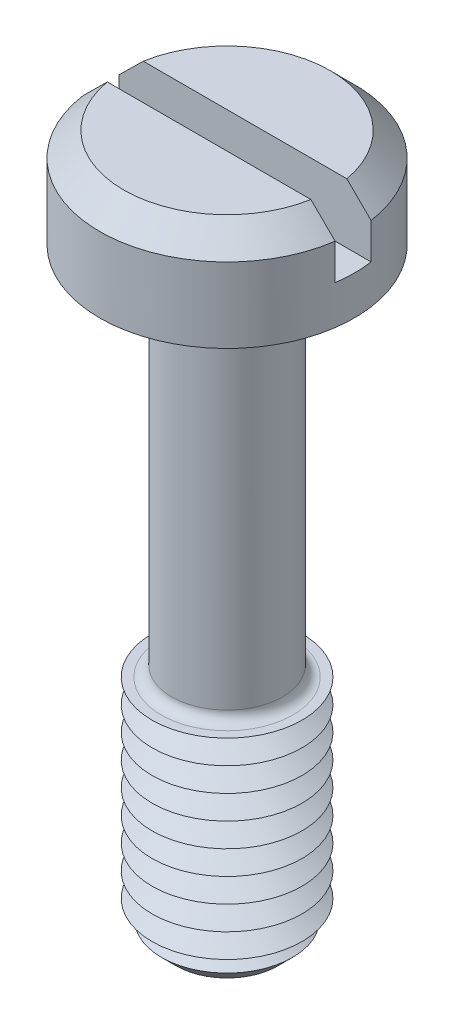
ISO-10303-21;
HEADER;
FILE_DESCRIPTION(('STEP AP214'),'2;1');
FILE_NAME('part.step','',(''),(''),'','','');
FILE_SCHEMA(('AUTOMOTIVE_DESIGN { 1 0 10303 214 1 1 1 1 }'));
ENDSEC;
DATA;
#1=APPLICATION_CONTEXT('core data for automotive mechanical design processes');
#2=APPLICATION_PROTOCOL_DEFINITION('international standard','automotive_design',2000,#1);
#3=PRODUCT_CONTEXT('',#1,'mechanical');
#4=PRODUCT('Part','Part','',(#3));
#5=PRODUCT_RELATED_PRODUCT_CATEGORY('part','',(#4));
#6=PRODUCT_DEFINITION_FORMATION('','',#4);
#7=PRODUCT_DEFINITION_CONTEXT('part definition',#1,'design');
#8=PRODUCT_DEFINITION('design','',#6,#7);
#9=PRODUCT_DEFINITION_SHAPE('','',#8);
#10=(LENGTH_UNIT() NAMED_UNIT(*) SI_UNIT(.MILLI.,.METRE.));
#11=(NAMED_UNIT(*) PLANE_ANGLE_UNIT() SI_UNIT($,.RADIAN.));
#12=(NAMED_UNIT(*) SI_UNIT($,.STERADIAN.) SOLID_ANGLE_UNIT());
#13=UNCERTAINTY_MEASURE_WITH_UNIT(LENGTH_MEASURE(1.E-05),#10,'distance_accuracy_value','');
#14=(GEOMETRIC_REPRESENTATION_CONTEXT(3) GLOBAL_UNCERTAINTY_ASSIGNED_CONTEXT((#13)) GLOBAL_UNIT_ASSIGNED_CONTEXT((#10,
#11,#12)) REPRESENTATION_CONTEXT('',''));
#15=CARTESIAN_POINT('',(0.,0.,0.));
#16=DIRECTION('',(0.,0.,1.));
#17=DIRECTION('',(1.,0.,0.));
#18=AXIS2_PLACEMENT_3D('',#15,#16,#17);
#19=CARTESIAN_POINT('',(0.,3.3,0.));
#20=DIRECTION('',(0.,1.,0.));
#21=DIRECTION('',(0.,0.,1.));
#22=AXIS2_PLACEMENT_3D('',#19,#20,#21);
#23=PLANE('',#22);
#24=DIRECTION('',(-1.,0.,0.));
#25=VECTOR('',#24,1.);
#26=CARTESIAN_POINT('',(4.25,3.3,-0.6));
#27=LINE('',#26,#25);
#28=CARTESIAN_POINT('',(3.39742549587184,3.3,-0.6));
#29=VERTEX_POINT('',#28);
#30=CARTESIAN_POINT('',(-3.39742549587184,3.3,-0.6));
#31=VERTEX_POINT('',#30);
#32=EDGE_CURVE('E110',#29,#31,#27,.T.);
#33=ORIENTED_EDGE('',*,*,#32,.F.);
#34=CARTESIAN_POINT('',(0.,3.3,0.));
#35=DIRECTION('',(0.,1.,0.));
#36=DIRECTION('',(0.,0.,1.));
#37=AXIS2_PLACEMENT_3D('',#34,#35,#36);
#38=CIRCLE('',#37,3.45);
#39=EDGE_CURVE('E113',#29,#31,#38,.T.);
#40=ORIENTED_EDGE('',*,*,#39,.T.);
#41=EDGE_LOOP('',(#33,#40));
#42=FACE_BOUND('',#41,.T.);
#43=ADVANCED_FACE('F39',(#42),#23,.T.);
#44=CARTESIAN_POINT('',(0.,3.3,0.));
#45=DIRECTION('',(0.,-1.,0.));
#46=DIRECTION('',(0.,0.,-1.));
#47=AXIS2_PLACEMENT_3D('',#44,#45,#46);
#48=CONICAL_SURFACE('',#47,3.45,0.785398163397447);
#49=CARTESIAN_POINT('',(9.35351408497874,-2.62273843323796,-0.6));
#50=CARTESIAN_POINT('',(9.03263557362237,-2.30252317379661,-0.6));
#51=CARTESIAN_POINT('',(8.71172811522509,-1.98233690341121,-0.6));
#52=CARTESIAN_POINT('',(8.06981262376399,-1.34205341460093,-0.6));
#53=CARTESIAN_POINT('',(7.74880458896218,-1.02195619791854,-0.6));
#54=CARTESIAN_POINT('',(7.10652460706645,-0.381761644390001,-0.6));
#55=CARTESIAN_POINT('',(6.78525260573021,-0.0616643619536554,-0.6));
#56=CARTESIAN_POINT('',(6.14251393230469,0.57832320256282,-0.6));
#57=CARTESIAN_POINT('',(5.82104726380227,0.898213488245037,-0.6));
#58=CARTESIAN_POINT('',(5.1719620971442,1.54347500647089,-0.6));
#59=CARTESIAN_POINT('',(4.84433778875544,1.86884039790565,-0.6));
#60=CARTESIAN_POINT('',(4.35244442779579,2.35644593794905,-0.6));
#61=CARTESIAN_POINT('',(4.18839924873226,2.51891187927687,-0.6));
#62=CARTESIAN_POINT('',(3.86009606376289,2.84362679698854,-0.6));
#63=CARTESIAN_POINT('',(3.69583805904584,3.00587577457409,-0.6));
#64=CARTESIAN_POINT('',(3.36705354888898,3.33001661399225,-0.6));
#65=CARTESIAN_POINT('',(3.20252712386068,3.49190855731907,-0.6));
#66=CARTESIAN_POINT('',(2.87298689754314,3.81520272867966,-0.6));
#67=CARTESIAN_POINT('',(2.70797308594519,3.97660494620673,-0.6));
#68=CARTESIAN_POINT('',(2.37716903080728,4.29858210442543,-0.6));
#69=CARTESIAN_POINT('',(2.21137886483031,4.45915712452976,-0.6));
#70=CARTESIAN_POINT('',(1.96157219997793,4.69884609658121,-0.6));
#71=CARTESIAN_POINT('',(1.87811785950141,4.77854546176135,-0.6));
#72=CARTESIAN_POINT('',(1.71066064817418,4.93736532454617,-0.6));
#73=CARTESIAN_POINT('',(1.62665778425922,5.01648582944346,-0.6));
#74=CARTESIAN_POINT('',(1.49655488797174,5.13773269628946,-0.6));
#75=CARTESIAN_POINT('',(1.45074972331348,5.18017521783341,-0.6));
#76=CARTESIAN_POINT('',(1.35882119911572,5.26471614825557,-0.6));
#77=CARTESIAN_POINT('',(1.31269783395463,5.30681455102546,-0.6));
#78=CARTESIAN_POINT('',(1.22008852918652,5.39050695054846,-0.6));
#79=CARTESIAN_POINT('',(1.17360305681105,5.43210146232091,-0.6));
#80=CARTESIAN_POINT('',(1.08007401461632,5.51465347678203,-0.6));
#81=CARTESIAN_POINT('',(1.03303046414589,5.55561100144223,-0.6));
#82=CARTESIAN_POINT('',(0.919047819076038,5.65299331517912,-0.6));
#83=CARTESIAN_POINT('',(0.851738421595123,5.7089924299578,-0.6));
#84=CARTESIAN_POINT('',(0.748806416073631,5.79068526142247,-0.6));
#85=CARTESIAN_POINT('',(0.714125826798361,5.8175621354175,-0.6));
#86=CARTESIAN_POINT('',(0.643915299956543,5.8701807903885,-0.6));
#87=CARTESIAN_POINT('',(0.608385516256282,5.89592277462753,-0.6));
#88=CARTESIAN_POINT('',(0.545162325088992,5.93955652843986,-0.6));
#89=CARTESIAN_POINT('',(0.517718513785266,5.95780799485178,-0.6));
#90=CARTESIAN_POINT('',(0.462025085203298,5.99303174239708,-0.6));
#91=CARTESIAN_POINT('',(0.433775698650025,6.01000438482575,-0.6));
#92=CARTESIAN_POINT('',(0.376341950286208,6.04213837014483,-0.6));
#93=CARTESIAN_POINT('',(0.347160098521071,6.05730412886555,-0.6));
#94=CARTESIAN_POINT('',(0.2876425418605,6.08513394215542,-0.6));
#95=CARTESIAN_POINT('',(0.25730803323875,6.0978005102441,-0.6));
#96=CARTESIAN_POINT('',(0.190863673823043,6.12124627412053,-0.6));
#97=CARTESIAN_POINT('',(0.154554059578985,6.13148571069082,-0.6));
#98=CARTESIAN_POINT('',(0.0807909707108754,6.14565404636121,-0.6));
#99=CARTESIAN_POINT('',(0.0433423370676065,6.14960664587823,-0.6));
#100=CARTESIAN_POINT('',(-0.0317987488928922,6.15033783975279,-0.6));
#101=CARTESIAN_POINT('',(-0.069491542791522,6.14708428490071,-0.6));
#102=CARTESIAN_POINT('',(-0.143790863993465,6.13410921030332,-0.6));
#103=CARTESIAN_POINT('',(-0.18039362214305,6.12436747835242,-0.6));
#104=CARTESIAN_POINT('',(-0.254098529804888,6.09939647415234,-0.6));
#105=CARTESIAN_POINT('',(-0.291094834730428,6.08386859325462,-0.6));
#106=CARTESIAN_POINT('',(-0.363408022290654,6.04924663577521,-0.6));
#107=CARTESIAN_POINT('',(-0.398721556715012,6.03014579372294,-0.6));
#108=CARTESIAN_POINT('',(-0.468234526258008,5.98944452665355,-0.6));
#109=CARTESIAN_POINT('',(-0.502422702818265,5.96782521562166,-0.6));
#110=CARTESIAN_POINT('',(-0.569689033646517,5.92300618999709,-0.6));
#111=CARTESIAN_POINT('',(-0.602768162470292,5.89980792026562,-0.6));
#112=CARTESIAN_POINT('',(-0.671148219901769,5.85008963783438,-0.6));
#113=CARTESIAN_POINT('',(-0.706369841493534,5.82346130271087,-0.6));
#114=CARTESIAN_POINT('',(-0.776087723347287,5.76926828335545,-0.6));
#115=CARTESIAN_POINT('',(-0.810583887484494,5.74170347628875,-0.6));
#116=CARTESIAN_POINT('',(-0.913286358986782,5.65798278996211,-0.6));
#117=CARTESIAN_POINT('',(-0.980673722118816,5.60082541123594,-0.6));
#118=CARTESIAN_POINT('',(-1.11424616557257,5.48490670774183,-0.6));
#119=CARTESIAN_POINT('',(-1.18042891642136,5.42614273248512,-0.6));
#120=CARTESIAN_POINT('',(-1.31191262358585,5.30767463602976,-0.6));
#121=CARTESIAN_POINT('',(-1.37721382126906,5.24797078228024,-0.6));
#122=CARTESIAN_POINT('',(-1.5070108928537,5.12812906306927,-0.6));
#123=CARTESIAN_POINT('',(-1.57150872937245,5.06799331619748,-0.6));
#124=CARTESIAN_POINT('',(-1.70009132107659,4.94727328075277,-0.6));
#125=CARTESIAN_POINT('',(-1.76417604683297,4.88668896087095,-0.6));
#126=CARTESIAN_POINT('',(-1.95584105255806,4.70458824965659,-0.6));
#127=CARTESIAN_POINT('',(-2.08296922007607,4.58259645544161,-0.6));
#128=CARTESIAN_POINT('',(-2.33599178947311,4.33840625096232,-0.6));
#129=CARTESIAN_POINT('',(-2.46188913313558,4.21621087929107,-0.6));
#130=CARTESIAN_POINT('',(-2.71323511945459,3.97135925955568,-0.6));
#131=CARTESIAN_POINT('',(-2.83868376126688,3.84870301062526,-0.6));
#132=CARTESIAN_POINT('',(-3.21459106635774,3.48027743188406,-0.6));
#133=CARTESIAN_POINT('',(-3.46460626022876,3.2340559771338,-0.6));
#134=CARTESIAN_POINT('',(-3.96413793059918,2.74090313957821,-0.6));
#135=CARTESIAN_POINT('',(-4.21365415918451,2.4939715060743,-0.6));
#136=CARTESIAN_POINT('',(-4.71232475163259,1.99974737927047,-0.6));
#137=CARTESIAN_POINT('',(-4.96147911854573,1.7524548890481,-0.6));
#138=CARTESIAN_POINT('',(-5.45958725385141,1.25761544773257,-0.6));
#139=CARTESIAN_POINT('',(-5.70854099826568,1.01006847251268,-0.6));
#140=CARTESIAN_POINT('',(-6.20629498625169,0.514819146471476,-0.6));
#141=CARTESIAN_POINT('',(-6.45509522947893,0.267116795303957,-0.6));
#142=CARTESIAN_POINT('',(-7.20128563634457,-0.476100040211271,-0.6));
#143=CARTESIAN_POINT('',(-7.69851620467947,-0.971774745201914,-0.6));
#144=CARTESIAN_POINT('',(-8.38865115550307,-1.66007026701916,-0.6));
#145=CARTESIAN_POINT('',(-8.58165346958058,-1.85259293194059,-0.6));
#146=CARTESIAN_POINT('',(-8.87112736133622,-2.14139225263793,-0.6));
#147=CARTESIAN_POINT('',(-8.96761014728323,-2.23765767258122,-0.6));
#148=CARTESIAN_POINT('',(-9.16056764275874,-2.43019387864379,-0.6));
#149=CARTESIAN_POINT('',(-9.25704235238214,-2.52646466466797,-0.6));
#150=CARTESIAN_POINT('',(-9.35351408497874,-2.62273843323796,-0.6));
#151=B_SPLINE_CURVE_WITH_KNOTS('',3,(#49,#50,#51,#52,#53,#54,#55,#56,#57,#58,#59,#60,#61,#62,
#63,#64,#65,#66,#67,#68,#69,#70,#71,#72,#73,#74,#75,#76,#77,#78,#79,#80,#81,#82,#83,#84,#85,#86,
#87,#88,#89,#90,#91,#92,#93,#94,#95,#96,#97,#98,#99,#100,#101,#102,#103,#104,#105,#106,#107,
#108,#109,#110,#111,#112,#113,#114,#115,#116,#117,#118,#119,#120,#121,#122,#123,#124,#125,#126,
#127,#128,#129,#130,#131,#132,#133,#134,#135,#136,#137,#138,#139,#140,#141,#142,#143,#144,#145,
#146,#147,#148,#149,#150),.UNSPECIFIED.,.F.,.F.,(4,2,2,2,2,2,2,2,2,2,2,2,2,2,2,2,2,2,2,2,2,2,2,
2,2,2,2,2,2,2,2,2,2,2,2,2,2,2,2,2,2,2,2,2,2,2,2,2,2,2,4),(0.,1.35996600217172,2.71995696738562,
4.08050889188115,5.44103646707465,6.82624457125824,7.51888721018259,8.21152599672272,
8.9039856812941,9.59646011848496,10.288866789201,10.635058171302,10.9812451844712,
11.1685812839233,11.3559207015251,11.5430489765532,11.7301707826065,11.9927784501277,
12.1243921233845,12.2559821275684,12.3548333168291,12.4536564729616,12.5522329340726,
12.6507097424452,12.763461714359,12.8757876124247,12.9886156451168,13.101796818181,
13.2218851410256,13.3422031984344,13.4634899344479,13.584667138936,13.7171086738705,
13.8495676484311,14.1146090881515,14.3801178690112,14.6455524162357,14.910099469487,
15.17466516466,15.7032346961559,16.2295761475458,16.7559185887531,17.8086237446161,
18.8617626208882,19.9148925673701,20.9681337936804,22.0213773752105,24.1276499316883,
24.9454725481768,25.3543534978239,25.7632286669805),.UNSPECIFIED.);
#152=CARTESIAN_POINT('',(4.20743389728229,2.49999999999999,-0.6));
#153=VERTEX_POINT('',#152);
#154=EDGE_CURVE('E268',#153,#29,#151,.T.);
#155=ORIENTED_EDGE('',*,*,#154,.F.);
#156=CARTESIAN_POINT('',(0.,2.5,0.));
#157=DIRECTION('',(0.,1.,0.));
#158=DIRECTION('',(0.,0.,1.));
#159=AXIS2_PLACEMENT_3D('',#156,#157,#158);
#160=CIRCLE('',#159,4.25);
#161=CARTESIAN_POINT('',(-4.20743389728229,2.49999999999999,-0.6));
#162=VERTEX_POINT('',#161);
#163=EDGE_CURVE('E128',#162,#153,#160,.F.);
#164=ORIENTED_EDGE('',*,*,#163,.F.);
#165=EDGE_CURVE('E102',#31,#162,#151,.T.);
#166=ORIENTED_EDGE('',*,*,#165,.F.);
#167=ORIENTED_EDGE('',*,*,#39,.F.);
#168=EDGE_LOOP('',(#155,#164,#166,#167));
#169=FACE_BOUND('',#168,.T.);
#170=ADVANCED_FACE('F230',(#169),#48,.T.);
#171=CARTESIAN_POINT('',(0.,-20.,0.));
#172=DIRECTION('',(0.,1.,0.));
#173=DIRECTION('',(0.,0.,1.));
#174=AXIS2_PLACEMENT_3D('',#171,#172,#173);
#175=CYLINDRICAL_SURFACE('',#174,1.85);
#176=CARTESIAN_POINT('',(0.,-12.15,0.));
#177=DIRECTION('',(0.,-1.,0.));
#178=DIRECTION('',(0.,0.,-1.));
#179=AXIS2_PLACEMENT_3D('',#176,#177,#178);
#180=CIRCLE('',#179,1.85);
#181=CARTESIAN_POINT('',(0.,-12.15,-1.85));
#182=VERTEX_POINT('',#181);
#183=EDGE_CURVE('E123',#182,#182,#180,.F.);
#184=ORIENTED_EDGE('',*,*,#183,.T.);
#185=EDGE_LOOP('',(#184));
#186=FACE_BOUND('',#185,.T.);
#187=CARTESIAN_POINT('',(0.,-0.35,0.));
#188=DIRECTION('',(0.,1.,0.));
#189=DIRECTION('',(0.,0.,1.));
#190=AXIS2_PLACEMENT_3D('',#187,#188,#189);
#191=CIRCLE('',#190,1.85);
#192=CARTESIAN_POINT('',(0.,-0.35,1.85));
#193=VERTEX_POINT('',#192);
#194=EDGE_CURVE('E382',#193,#193,#191,.F.);
#195=ORIENTED_EDGE('',*,*,#194,.T.);
#196=EDGE_LOOP('',(#195));
#197=FACE_BOUND('',#196,.T.);
#198=ADVANCED_FACE('F226',(#186,#197),#175,.T.);
#199=CARTESIAN_POINT('',(0.,3.3,0.));
#200=DIRECTION('',(0.,-1.,0.));
#201=DIRECTION('',(0.,0.,-1.));
#202=AXIS2_PLACEMENT_3D('',#199,#200,#201);
#203=CYLINDRICAL_SURFACE('',#202,4.25);
#204=ORIENTED_EDGE('',*,*,#163,.T.);
#205=DIRECTION('',(0.,-1.,0.));
#206=VECTOR('',#205,1.);
#207=CARTESIAN_POINT('',(4.20743389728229,3.3,-0.6));
#208=LINE('',#207,#206);
#209=CARTESIAN_POINT('',(4.20743389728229,1.3,-0.6));
#210=VERTEX_POINT('',#209);
#211=EDGE_CURVE('E64',#153,#210,#208,.T.);
#212=ORIENTED_EDGE('',*,*,#211,.T.);
#213=CARTESIAN_POINT('',(0.,1.3,0.));
#214=DIRECTION('',(0.,1.,0.));
#215=DIRECTION('',(0.,0.,1.));
#216=AXIS2_PLACEMENT_3D('',#213,#214,#215);
#217=CIRCLE('',#216,4.25);
#218=CARTESIAN_POINT('',(4.20743389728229,1.3,0.6));
#219=VERTEX_POINT('',#218);
#220=EDGE_CURVE('E11',#219,#210,#217,.T.);
#221=ORIENTED_EDGE('',*,*,#220,.F.);
#222=DIRECTION('',(0.,-1.,0.));
#223=VECTOR('',#222,1.);
#224=CARTESIAN_POINT('',(4.20743389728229,3.3,0.6));
#225=LINE('',#224,#223);
#226=CARTESIAN_POINT('',(4.20743389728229,2.49999999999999,0.6));
#227=VERTEX_POINT('',#226);
#228=EDGE_CURVE('E284',#219,#227,#225,.F.);
#229=ORIENTED_EDGE('',*,*,#228,.T.);
#230=CARTESIAN_POINT('',(-4.20743389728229,2.49999999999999,0.6));
#231=VERTEX_POINT('',#230);
#232=EDGE_CURVE('E120',#227,#231,#160,.F.);
#233=ORIENTED_EDGE('',*,*,#232,.T.);
#234=DIRECTION('',(0.,-1.,0.));
#235=VECTOR('',#234,1.);
#236=CARTESIAN_POINT('',(-4.20743389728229,3.3,0.6));
#237=LINE('',#236,#235);
#238=CARTESIAN_POINT('',(-4.20743389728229,1.3,0.6));
#239=VERTEX_POINT('',#238);
#240=EDGE_CURVE('E96',#231,#239,#237,.T.);
#241=ORIENTED_EDGE('',*,*,#240,.T.);
#242=CARTESIAN_POINT('',(-4.20743389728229,1.3,-0.6));
#243=VERTEX_POINT('',#242);
#244=EDGE_CURVE('E44',#243,#239,#217,.T.);
#245=ORIENTED_EDGE('',*,*,#244,.F.);
#246=DIRECTION('',(0.,-1.,0.));
#247=VECTOR('',#246,1.);
#248=CARTESIAN_POINT('',(-4.20743389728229,3.3,-0.6));
#249=LINE('',#248,#247);
#250=EDGE_CURVE('E289',#243,#162,#249,.F.);
#251=ORIENTED_EDGE('',*,*,#250,.T.);
#252=EDGE_LOOP('',(#204,#212,#221,#229,#233,#241,#245,#251));
#253=FACE_BOUND('',#252,.T.);
#254=CARTESIAN_POINT('',(0.,0.,0.));
#255=DIRECTION('',(0.,1.,0.));
#256=DIRECTION('',(0.,0.,1.));
#257=AXIS2_PLACEMENT_3D('',#254,#255,#256);
#258=CIRCLE('',#257,4.25);
#259=CARTESIAN_POINT('',(0.,0.,4.25));
#260=VERTEX_POINT('',#259);
#261=EDGE_CURVE('E368',#260,#260,#258,.T.);
#262=ORIENTED_EDGE('',*,*,#261,.T.);
#263=EDGE_LOOP('',(#262));
#264=FACE_BOUND('',#263,.T.);
#265=ADVANCED_FACE('F229',(#253,#264),#203,.T.);
#266=DIRECTION('',(1.,0.,0.));
#267=VECTOR('',#266,1.);
#268=CARTESIAN_POINT('',(4.25,3.3,0.6));
#269=LINE('',#268,#267);
#270=CARTESIAN_POINT('',(-3.39742549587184,3.3,0.6));
#271=VERTEX_POINT('',#270);
#272=CARTESIAN_POINT('',(3.39742549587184,3.3,0.6));
#273=VERTEX_POINT('',#272);
#274=EDGE_CURVE('E56',#271,#273,#269,.T.);
#275=ORIENTED_EDGE('',*,*,#274,.F.);
#276=EDGE_CURVE('E108',#271,#273,#38,.T.);
#277=ORIENTED_EDGE('',*,*,#276,.T.);
#278=EDGE_LOOP('',(#275,#277));
#279=FACE_BOUND('',#278,.T.);
#280=ADVANCED_FACE('F107',(#279),#23,.T.);
#281=CARTESIAN_POINT('',(0.,0.,0.));
#282=DIRECTION('',(0.,1.,0.));
#283=DIRECTION('',(0.,0.,1.));
#284=AXIS2_PLACEMENT_3D('',#281,#282,#283);
#285=PLANE('',#284);
#286=CARTESIAN_POINT('',(0.,0.,0.));
#287=DIRECTION('',(0.,1.,0.));
#288=DIRECTION('',(0.,0.,1.));
#289=AXIS2_PLACEMENT_3D('',#286,#287,#288);
#290=CIRCLE('',#289,2.2);
#291=CARTESIAN_POINT('',(0.,0.,2.2));
#292=VERTEX_POINT('',#291);
#293=EDGE_CURVE('E114',#292,#292,#290,.T.);
#294=ORIENTED_EDGE('',*,*,#293,.T.);
#295=EDGE_LOOP('',(#294));
#296=FACE_BOUND('',#295,.T.);
#297=ORIENTED_EDGE('',*,*,#261,.F.);
#298=EDGE_LOOP('',(#297));
#299=FACE_BOUND('',#298,.T.);
#300=ADVANCED_FACE('F220',(#296,#299),#285,.F.);
#301=CARTESIAN_POINT('',(0.,-12.5,0.));
#302=DIRECTION('',(0.,-1.,0.));
#303=DIRECTION('',(0.,0.,-1.));
#304=AXIS2_PLACEMENT_3D('',#301,#302,#303);
#305=PLANE('',#304);
#306=CARTESIAN_POINT('',(0.,-12.5,0.));
#307=DIRECTION('',(0.,-1.,0.));
#308=DIRECTION('',(0.,0.,-1.));
#309=AXIS2_PLACEMENT_3D('',#306,#307,#308);
#310=CIRCLE('',#309,2.2);
#311=CARTESIAN_POINT('',(0.,-12.5,-2.2));
#312=VERTEX_POINT('',#311);
#313=EDGE_CURVE('E375',#312,#312,#310,.T.);
#314=ORIENTED_EDGE('',*,*,#313,.T.);
#315=EDGE_LOOP('',(#314));
#316=FACE_BOUND('',#315,.T.);
#317=CARTESIAN_POINT('',(0.,-12.5,0.));
#318=DIRECTION('',(0.,1.,0.));
#319=DIRECTION('',(0.,0.,1.));
#320=AXIS2_PLACEMENT_3D('',#317,#318,#319);
#321=CIRCLE('',#320,2.5);
#322=CARTESIAN_POINT('',(0.,-12.5,2.5));
#323=VERTEX_POINT('',#322);
#324=EDGE_CURVE('E364',#323,#323,#321,.T.);
#325=ORIENTED_EDGE('',*,*,#324,.T.);
#326=EDGE_LOOP('',(#325));
#327=FACE_BOUND('',#326,.T.);
#328=ADVANCED_FACE('F216',(#316,#327),#305,.F.);
#329=CARTESIAN_POINT('',(0.,-12.9,0.));
#330=DIRECTION('',(0.,1.,0.));
#331=DIRECTION('',(0.,0.,1.));
#332=AXIS2_PLACEMENT_3D('',#329,#330,#331);
#333=CONICAL_SURFACE('',#332,1.80717967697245,1.0471975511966);
#334=ORIENTED_EDGE('',*,*,#324,.F.);
#335=EDGE_LOOP('',(#334));
#336=FACE_BOUND('',#335,.T.);
#337=CARTESIAN_POINT('',(0.,-12.9,0.));
#338=DIRECTION('',(0.,1.,0.));
#339=DIRECTION('',(0.,0.,1.));
#340=AXIS2_PLACEMENT_3D('',#337,#338,#339);
#341=CIRCLE('',#340,1.80717967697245);
#342=CARTESIAN_POINT('',(0.,-12.9,1.80717967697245));
#343=VERTEX_POINT('',#342);
#344=EDGE_CURVE('E360',#343,#343,#341,.T.);
#345=ORIENTED_EDGE('',*,*,#344,.T.);
#346=EDGE_LOOP('',(#345));
#347=FACE_BOUND('',#346,.T.);
#348=ADVANCED_FACE('F212',(#336,#347),#333,.T.);
#349=CARTESIAN_POINT('',(0.,-13.3,0.));
#350=DIRECTION('',(0.,-1.,0.));
#351=DIRECTION('',(0.,0.,-1.));
#352=AXIS2_PLACEMENT_3D('',#349,#350,#351);
#353=CONICAL_SURFACE('',#352,2.5,1.0471975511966);
#354=ORIENTED_EDGE('',*,*,#344,.F.);
#355=EDGE_LOOP('',(#354));
#356=FACE_BOUND('',#355,.T.);
#357=CARTESIAN_POINT('',(0.,-13.3,0.));
#358=DIRECTION('',(0.,1.,0.));
#359=DIRECTION('',(0.,0.,1.));
#360=AXIS2_PLACEMENT_3D('',#357,#358,#359);
#361=CIRCLE('',#360,2.5);
#362=CARTESIAN_POINT('',(0.,-13.3,2.5));
#363=VERTEX_POINT('',#362);
#364=EDGE_CURVE('E356',#363,#363,#361,.T.);
#365=ORIENTED_EDGE('',*,*,#364,.T.);
#366=EDGE_LOOP('',(#365));
#367=FACE_BOUND('',#366,.T.);
#368=ADVANCED_FACE('F208',(#356,#367),#353,.T.);
#369=CARTESIAN_POINT('',(0.,-13.7,0.));
#370=DIRECTION('',(0.,1.,0.));
#371=DIRECTION('',(0.,0.,1.));
#372=AXIS2_PLACEMENT_3D('',#369,#370,#371);
#373=CONICAL_SURFACE('',#372,1.80717967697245,1.0471975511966);
#374=ORIENTED_EDGE('',*,*,#364,.F.);
#375=EDGE_LOOP('',(#374));
#376=FACE_BOUND('',#375,.T.);
#377=CARTESIAN_POINT('',(0.,-13.7,0.));
#378=DIRECTION('',(0.,1.,0.));
#379=DIRECTION('',(0.,0.,1.));
#380=AXIS2_PLACEMENT_3D('',#377,#378,#379);
#381=CIRCLE('',#380,1.80717967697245);
#382=CARTESIAN_POINT('',(0.,-13.7,1.80717967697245));
#383=VERTEX_POINT('',#382);
#384=EDGE_CURVE('E353',#383,#383,#381,.T.);
#385=ORIENTED_EDGE('',*,*,#384,.T.);
#386=EDGE_LOOP('',(#385));
#387=FACE_BOUND('',#386,.T.);
#388=ADVANCED_FACE('F204',(#376,#387),#373,.T.);
#389=CARTESIAN_POINT('',(0.,-14.1,0.));
#390=DIRECTION('',(0.,-1.,0.));
#391=DIRECTION('',(0.,0.,-1.));
#392=AXIS2_PLACEMENT_3D('',#389,#390,#391);
#393=CONICAL_SURFACE('',#392,2.5,1.0471975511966);
#394=ORIENTED_EDGE('',*,*,#384,.F.);
#395=EDGE_LOOP('',(#394));
#396=FACE_BOUND('',#395,.T.);
#397=CARTESIAN_POINT('',(0.,-14.1,0.));
#398=DIRECTION('',(0.,1.,0.));
#399=DIRECTION('',(0.,0.,1.));
#400=AXIS2_PLACEMENT_3D('',#397,#398,#399);
#401=CIRCLE('',#400,2.5);
#402=CARTESIAN_POINT('',(0.,-14.1,2.5));
#403=VERTEX_POINT('',#402);
#404=EDGE_CURVE('E349',#403,#403,#401,.T.);
#405=ORIENTED_EDGE('',*,*,#404,.T.);
#406=EDGE_LOOP('',(#405));
#407=FACE_BOUND('',#406,.T.);
#408=ADVANCED_FACE('F200',(#396,#407),#393,.T.);
#409=CARTESIAN_POINT('',(0.,-14.5,0.));
#410=DIRECTION('',(0.,1.,0.));
#411=DIRECTION('',(0.,0.,1.));
#412=AXIS2_PLACEMENT_3D('',#409,#410,#411);
#413=CONICAL_SURFACE('',#412,1.80717967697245,1.0471975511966);
#414=ORIENTED_EDGE('',*,*,#404,.F.);
#415=EDGE_LOOP('',(#414));
#416=FACE_BOUND('',#415,.T.);
#417=CARTESIAN_POINT('',(0.,-14.5,0.));
#418=DIRECTION('',(0.,1.,0.));
#419=DIRECTION('',(0.,0.,1.));
#420=AXIS2_PLACEMENT_3D('',#417,#418,#419);
#421=CIRCLE('',#420,1.80717967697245);
#422=CARTESIAN_POINT('',(0.,-14.5,1.80717967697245));
#423=VERTEX_POINT('',#422);
#424=EDGE_CURVE('E345',#423,#423,#421,.T.);
#425=ORIENTED_EDGE('',*,*,#424,.T.);
#426=EDGE_LOOP('',(#425));
#427=FACE_BOUND('',#426,.T.);
#428=ADVANCED_FACE('F196',(#416,#427),#413,.T.);
#429=CARTESIAN_POINT('',(0.,-14.9,0.));
#430=DIRECTION('',(0.,-1.,0.));
#431=DIRECTION('',(0.,0.,-1.));
#432=AXIS2_PLACEMENT_3D('',#429,#430,#431);
#433=CONICAL_SURFACE('',#432,2.5,1.0471975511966);
#434=ORIENTED_EDGE('',*,*,#424,.F.);
#435=EDGE_LOOP('',(#434));
#436=FACE_BOUND('',#435,.T.);
#437=CARTESIAN_POINT('',(0.,-14.9,0.));
#438=DIRECTION('',(0.,1.,0.));
#439=DIRECTION('',(0.,0.,1.));
#440=AXIS2_PLACEMENT_3D('',#437,#438,#439);
#441=CIRCLE('',#440,2.5);
#442=CARTESIAN_POINT('',(0.,-14.9,2.5));
#443=VERTEX_POINT('',#442);
#444=EDGE_CURVE('E342',#443,#443,#441,.T.);
#445=ORIENTED_EDGE('',*,*,#444,.T.);
#446=EDGE_LOOP('',(#445));
#447=FACE_BOUND('',#446,.T.);
#448=ADVANCED_FACE('F192',(#436,#447),#433,.T.);
#449=CARTESIAN_POINT('',(0.,-15.3,0.));
#450=DIRECTION('',(0.,1.,0.));
#451=DIRECTION('',(0.,0.,1.));
#452=AXIS2_PLACEMENT_3D('',#449,#450,#451);
#453=CONICAL_SURFACE('',#452,1.80717967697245,1.0471975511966);
#454=ORIENTED_EDGE('',*,*,#444,.F.);
#455=EDGE_LOOP('',(#454));
#456=FACE_BOUND('',#455,.T.);
#457=CARTESIAN_POINT('',(0.,-15.3,0.));
#458=DIRECTION('',(0.,1.,0.));
#459=DIRECTION('',(0.,0.,1.));
#460=AXIS2_PLACEMENT_3D('',#457,#458,#459);
#461=CIRCLE('',#460,1.80717967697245);
#462=CARTESIAN_POINT('',(0.,-15.3,1.80717967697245));
#463=VERTEX_POINT('',#462);
#464=EDGE_CURVE('E338',#463,#463,#461,.T.);
#465=ORIENTED_EDGE('',*,*,#464,.T.);
#466=EDGE_LOOP('',(#465));
#467=FACE_BOUND('',#466,.T.);
#468=ADVANCED_FACE('F188',(#456,#467),#453,.T.);
#469=CARTESIAN_POINT('',(0.,-15.7,0.));
#470=DIRECTION('',(0.,-1.,0.));
#471=DIRECTION('',(0.,0.,-1.));
#472=AXIS2_PLACEMENT_3D('',#469,#470,#471);
#473=CONICAL_SURFACE('',#472,2.5,1.0471975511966);
#474=ORIENTED_EDGE('',*,*,#464,.F.);
#475=EDGE_LOOP('',(#474));
#476=FACE_BOUND('',#475,.T.);
#477=CARTESIAN_POINT('',(0.,-15.7,0.));
#478=DIRECTION('',(0.,1.,0.));
#479=DIRECTION('',(0.,0.,1.));
#480=AXIS2_PLACEMENT_3D('',#477,#478,#479);
#481=CIRCLE('',#480,2.5);
#482=CARTESIAN_POINT('',(0.,-15.7,2.5));
#483=VERTEX_POINT('',#482);
#484=EDGE_CURVE('E334',#483,#483,#481,.T.);
#485=ORIENTED_EDGE('',*,*,#484,.T.);
#486=EDGE_LOOP('',(#485));
#487=FACE_BOUND('',#486,.T.);
#488=ADVANCED_FACE('F184',(#476,#487),#473,.T.);
#489=CARTESIAN_POINT('',(0.,-16.1,0.));
#490=DIRECTION('',(0.,1.,0.));
#491=DIRECTION('',(0.,0.,1.));
#492=AXIS2_PLACEMENT_3D('',#489,#490,#491);
#493=CONICAL_SURFACE('',#492,1.80717967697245,1.0471975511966);
#494=ORIENTED_EDGE('',*,*,#484,.F.);
#495=EDGE_LOOP('',(#494));
#496=FACE_BOUND('',#495,.T.);
#497=CARTESIAN_POINT('',(0.,-16.1,0.));
#498=DIRECTION('',(0.,1.,0.));
#499=DIRECTION('',(0.,0.,1.));
#500=AXIS2_PLACEMENT_3D('',#497,#498,#499);
#501=CIRCLE('',#500,1.80717967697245);
#502=CARTESIAN_POINT('',(0.,-16.1,1.80717967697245));
#503=VERTEX_POINT('',#502);
#504=EDGE_CURVE('E330',#503,#503,#501,.T.);
#505=ORIENTED_EDGE('',*,*,#504,.T.);
#506=EDGE_LOOP('',(#505));
#507=FACE_BOUND('',#506,.T.);
#508=ADVANCED_FACE('F180',(#496,#507),#493,.T.);
#509=CARTESIAN_POINT('',(0.,-16.5,0.));
#510=DIRECTION('',(0.,-1.,0.));
#511=DIRECTION('',(0.,0.,-1.));
#512=AXIS2_PLACEMENT_3D('',#509,#510,#511);
#513=CONICAL_SURFACE('',#512,2.5,1.0471975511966);
#514=ORIENTED_EDGE('',*,*,#504,.F.);
#515=EDGE_LOOP('',(#514));
#516=FACE_BOUND('',#515,.T.);
#517=CARTESIAN_POINT('',(0.,-16.5,0.));
#518=DIRECTION('',(0.,1.,0.));
#519=DIRECTION('',(0.,0.,1.));
#520=AXIS2_PLACEMENT_3D('',#517,#518,#519);
#521=CIRCLE('',#520,2.5);
#522=CARTESIAN_POINT('',(0.,-16.5,2.5));
#523=VERTEX_POINT('',#522);
#524=EDGE_CURVE('E327',#523,#523,#521,.T.);
#525=ORIENTED_EDGE('',*,*,#524,.T.);
#526=EDGE_LOOP('',(#525));
#527=FACE_BOUND('',#526,.T.);
#528=ADVANCED_FACE('F176',(#516,#527),#513,.T.);
#529=CARTESIAN_POINT('',(0.,-16.9,0.));
#530=DIRECTION('',(0.,1.,0.));
#531=DIRECTION('',(0.,0.,1.));
#532=AXIS2_PLACEMENT_3D('',#529,#530,#531);
#533=CONICAL_SURFACE('',#532,1.80717967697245,1.0471975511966);
#534=ORIENTED_EDGE('',*,*,#524,.F.);
#535=EDGE_LOOP('',(#534));
#536=FACE_BOUND('',#535,.T.);
#537=CARTESIAN_POINT('',(0.,-16.9,0.));
#538=DIRECTION('',(0.,1.,0.));
#539=DIRECTION('',(0.,0.,1.));
#540=AXIS2_PLACEMENT_3D('',#537,#538,#539);
#541=CIRCLE('',#540,1.80717967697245);
#542=CARTESIAN_POINT('',(0.,-16.9,1.80717967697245));
#543=VERTEX_POINT('',#542);
#544=EDGE_CURVE('E323',#543,#543,#541,.T.);
#545=ORIENTED_EDGE('',*,*,#544,.T.);
#546=EDGE_LOOP('',(#545));
#547=FACE_BOUND('',#546,.T.);
#548=ADVANCED_FACE('F172',(#536,#547),#533,.T.);
#549=CARTESIAN_POINT('',(0.,-17.3,0.));
#550=DIRECTION('',(0.,-1.,0.));
#551=DIRECTION('',(0.,0.,-1.));
#552=AXIS2_PLACEMENT_3D('',#549,#550,#551);
#553=CONICAL_SURFACE('',#552,2.5,1.0471975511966);
#554=ORIENTED_EDGE('',*,*,#544,.F.);
#555=EDGE_LOOP('',(#554));
#556=FACE_BOUND('',#555,.T.);
#557=CARTESIAN_POINT('',(0.,-17.3,0.));
#558=DIRECTION('',(0.,1.,0.));
#559=DIRECTION('',(0.,0.,1.));
#560=AXIS2_PLACEMENT_3D('',#557,#558,#559);
#561=CIRCLE('',#560,2.5);
#562=CARTESIAN_POINT('',(0.,-17.3,2.5));
#563=VERTEX_POINT('',#562);
#564=EDGE_CURVE('E320',#563,#563,#561,.T.);
#565=ORIENTED_EDGE('',*,*,#564,.T.);
#566=EDGE_LOOP('',(#565));
#567=FACE_BOUND('',#566,.T.);
#568=ADVANCED_FACE('F168',(#556,#567),#553,.T.);
#569=CARTESIAN_POINT('',(0.,-17.7,0.));
#570=DIRECTION('',(0.,1.,0.));
#571=DIRECTION('',(0.,0.,1.));
#572=AXIS2_PLACEMENT_3D('',#569,#570,#571);
#573=CONICAL_SURFACE('',#572,1.80717967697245,1.0471975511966);
#574=ORIENTED_EDGE('',*,*,#564,.F.);
#575=EDGE_LOOP('',(#574));
#576=FACE_BOUND('',#575,.T.);
#577=CARTESIAN_POINT('',(0.,-17.7,0.));
#578=DIRECTION('',(0.,1.,0.));
#579=DIRECTION('',(0.,0.,1.));
#580=AXIS2_PLACEMENT_3D('',#577,#578,#579);
#581=CIRCLE('',#580,1.80717967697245);
#582=CARTESIAN_POINT('',(0.,-17.7,1.80717967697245));
#583=VERTEX_POINT('',#582);
#584=EDGE_CURVE('E316',#583,#583,#581,.T.);
#585=ORIENTED_EDGE('',*,*,#584,.T.);
#586=EDGE_LOOP('',(#585));
#587=FACE_BOUND('',#586,.T.);
#588=ADVANCED_FACE('F164',(#576,#587),#573,.T.);
#589=CARTESIAN_POINT('',(0.,-18.1,0.));
#590=DIRECTION('',(0.,-1.,0.));
#591=DIRECTION('',(0.,0.,-1.));
#592=AXIS2_PLACEMENT_3D('',#589,#590,#591);
#593=CONICAL_SURFACE('',#592,2.5,1.0471975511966);
#594=ORIENTED_EDGE('',*,*,#584,.F.);
#595=EDGE_LOOP('',(#594));
#596=FACE_BOUND('',#595,.T.);
#597=CARTESIAN_POINT('',(0.,-18.1,0.));
#598=DIRECTION('',(0.,1.,0.));
#599=DIRECTION('',(0.,0.,1.));
#600=AXIS2_PLACEMENT_3D('',#597,#598,#599);
#601=CIRCLE('',#600,2.5);
#602=CARTESIAN_POINT('',(0.,-18.1,2.5));
#603=VERTEX_POINT('',#602);
#604=EDGE_CURVE('E312',#603,#603,#601,.T.);
#605=ORIENTED_EDGE('',*,*,#604,.T.);
#606=EDGE_LOOP('',(#605));
#607=FACE_BOUND('',#606,.T.);
#608=ADVANCED_FACE('F160',(#596,#607),#593,.T.);
#609=CARTESIAN_POINT('',(0.,-18.5,0.));
#610=DIRECTION('',(0.,1.,0.));
#611=DIRECTION('',(0.,0.,1.));
#612=AXIS2_PLACEMENT_3D('',#609,#610,#611);
#613=CONICAL_SURFACE('',#612,1.80717967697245,1.0471975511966);
#614=ORIENTED_EDGE('',*,*,#604,.F.);
#615=EDGE_LOOP('',(#614));
#616=FACE_BOUND('',#615,.T.);
#617=CARTESIAN_POINT('',(0.,-18.5,0.));
#618=DIRECTION('',(0.,1.,0.));
#619=DIRECTION('',(0.,0.,1.));
#620=AXIS2_PLACEMENT_3D('',#617,#618,#619);
#621=CIRCLE('',#620,1.80717967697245);
#622=CARTESIAN_POINT('',(0.,-18.5,1.80717967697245));
#623=VERTEX_POINT('',#622);
#624=EDGE_CURVE('E308',#623,#623,#621,.T.);
#625=ORIENTED_EDGE('',*,*,#624,.T.);
#626=EDGE_LOOP('',(#625));
#627=FACE_BOUND('',#626,.T.);
#628=ADVANCED_FACE('F156',(#616,#627),#613,.T.);
#629=CARTESIAN_POINT('',(0.,-18.9,0.));
#630=DIRECTION('',(0.,-1.,0.));
#631=DIRECTION('',(0.,0.,-1.));
#632=AXIS2_PLACEMENT_3D('',#629,#630,#631);
#633=CONICAL_SURFACE('',#632,2.5,1.0471975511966);
#634=ORIENTED_EDGE('',*,*,#624,.F.);
#635=EDGE_LOOP('',(#634));
#636=FACE_BOUND('',#635,.T.);
#637=CARTESIAN_POINT('',(0.,-18.9,0.));
#638=DIRECTION('',(0.,1.,0.));
#639=DIRECTION('',(0.,0.,1.));
#640=AXIS2_PLACEMENT_3D('',#637,#638,#639);
#641=CIRCLE('',#640,2.5);
#642=CARTESIAN_POINT('',(0.,-18.9,2.5));
#643=VERTEX_POINT('',#642);
#644=EDGE_CURVE('E303',#643,#643,#641,.T.);
#645=ORIENTED_EDGE('',*,*,#644,.T.);
#646=EDGE_LOOP('',(#645));
#647=FACE_BOUND('',#646,.T.);
#648=ADVANCED_FACE('F152',(#636,#647),#633,.T.);
#649=CARTESIAN_POINT('',(0.,-19.3,0.));
#650=DIRECTION('',(0.,1.,0.));
#651=DIRECTION('',(0.,0.,1.));
#652=AXIS2_PLACEMENT_3D('',#649,#650,#651);
#653=CONICAL_SURFACE('',#652,1.80717967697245,1.0471975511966);
#654=ORIENTED_EDGE('',*,*,#644,.F.);
#655=EDGE_LOOP('',(#654));
#656=FACE_BOUND('',#655,.T.);
#657=CARTESIAN_POINT('',(0.,-19.3,0.));
#658=DIRECTION('',(0.,1.,0.));
#659=DIRECTION('',(0.,0.,1.));
#660=AXIS2_PLACEMENT_3D('',#657,#658,#659);
#661=CIRCLE('',#660,1.80717967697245);
#662=CARTESIAN_POINT('',(0.,-19.3,1.80717967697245));
#663=VERTEX_POINT('',#662);
#664=EDGE_CURVE('E299',#663,#663,#661,.T.);
#665=ORIENTED_EDGE('',*,*,#664,.T.);
#666=EDGE_LOOP('',(#665));
#667=FACE_BOUND('',#666,.T.);
#668=ADVANCED_FACE('F148',(#656,#667),#653,.T.);
#669=CARTESIAN_POINT('',(0.,-19.7,0.));
#670=DIRECTION('',(0.,-1.,0.));
#671=DIRECTION('',(0.,0.,-1.));
#672=AXIS2_PLACEMENT_3D('',#669,#670,#671);
#673=CONICAL_SURFACE('',#672,2.5,1.0471975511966);
#674=CARTESIAN_POINT('',(0.,-19.5169872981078,0.));
#675=DIRECTION('',(0.,-1.,0.));
#676=DIRECTION('',(0.,0.,-1.));
#677=AXIS2_PLACEMENT_3D('',#674,#675,#676);
#678=CIRCLE('',#677,2.18301270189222);
#679=CARTESIAN_POINT('',(0.,-19.5169872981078,2.18301270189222));
#680=VERTEX_POINT('',#679);
#681=EDGE_CURVE('E307',#680,#680,#678,.F.);
#682=ORIENTED_EDGE('',*,*,#681,.T.);
#683=EDGE_LOOP('',(#682));
#684=FACE_BOUND('',#683,.T.);
#685=ORIENTED_EDGE('',*,*,#664,.F.);
#686=EDGE_LOOP('',(#685));
#687=FACE_BOUND('',#686,.T.);
#688=ADVANCED_FACE('F144',(#684,#687),#673,.T.);
#689=CARTESIAN_POINT('',(0.,-20.,0.));
#690=DIRECTION('',(0.,-1.,0.));
#691=DIRECTION('',(0.,0.,-1.));
#692=AXIS2_PLACEMENT_3D('',#689,#690,#691);
#693=PLANE('',#692);
#694=CARTESIAN_POINT('',(0.,-20.,0.));
#695=DIRECTION('',(0.,-1.,0.));
#696=DIRECTION('',(0.,0.,-1.));
#697=AXIS2_PLACEMENT_3D('',#694,#695,#696);
#698=CIRCLE('',#697,1.7);
#699=CARTESIAN_POINT('',(0.,-20.,1.70000000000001));
#700=VERTEX_POINT('',#699);
#701=EDGE_CURVE('E371',#700,#700,#698,.T.);
#702=ORIENTED_EDGE('',*,*,#701,.T.);
#703=EDGE_LOOP('',(#702));
#704=FACE_BOUND('',#703,.T.);
#705=ADVANCED_FACE('F147',(#704),#693,.T.);
#706=CARTESIAN_POINT('',(0.,-20.,0.));
#707=DIRECTION('',(0.,1.,0.));
#708=DIRECTION('',(0.,0.,1.));
#709=AXIS2_PLACEMENT_3D('',#706,#707,#708);
#710=CONICAL_SURFACE('',#709,1.7,0.785398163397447);
#711=CARTESIAN_POINT('',(0.,-19.5169872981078,2.18301270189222));
#712=CARTESIAN_POINT('',(0.,-19.5220186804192,2.17798131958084));
#713=CARTESIAN_POINT('',(0.,-19.5270500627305,2.17294993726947));
#714=CARTESIAN_POINT('',(0.,-19.5371128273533,2.16288717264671));
#715=CARTESIAN_POINT('',(0.,-19.5421442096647,2.15785579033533));
#716=CARTESIAN_POINT('',(0.,-19.5522069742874,2.14779302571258));
#717=CARTESIAN_POINT('',(0.,-19.5572383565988,2.1427616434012));
#718=CARTESIAN_POINT('',(0.,-19.5673011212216,2.13269887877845));
#719=CARTESIAN_POINT('',(0.,-19.5723325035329,2.12766749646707));
#720=CARTESIAN_POINT('',(0.,-19.5823952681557,2.11760473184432));
#721=CARTESIAN_POINT('',(0.,-19.5874266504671,2.11257334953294));
#722=CARTESIAN_POINT('',(0.,-19.5974894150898,2.10251058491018));
#723=CARTESIAN_POINT('',(0.,-19.6025207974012,2.09747920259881));
#724=CARTESIAN_POINT('',(0.,-19.6125835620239,2.08741643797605));
#725=CARTESIAN_POINT('',(0.,-19.6176149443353,2.08238505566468));
#726=CARTESIAN_POINT('',(0.,-19.6276777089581,2.07232229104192));
#727=CARTESIAN_POINT('',(0.,-19.6327090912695,2.06729090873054));
#728=CARTESIAN_POINT('',(0.,-19.6427718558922,2.05722814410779));
#729=CARTESIAN_POINT('',(0.,-19.6478032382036,2.05219676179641));
#730=CARTESIAN_POINT('',(0.,-19.6578660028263,2.04213399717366));
#731=CARTESIAN_POINT('',(0.,-19.6628973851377,2.03710261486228));
#732=CARTESIAN_POINT('',(0.,-19.6729601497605,2.02703985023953));
#733=CARTESIAN_POINT('',(0.,-19.6779915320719,2.02200846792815));
#734=CARTESIAN_POINT('',(0.,-19.6880542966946,2.01194570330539));
#735=CARTESIAN_POINT('',(0.,-19.693085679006,2.00691432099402));
#736=CARTESIAN_POINT('',(0.,-19.7031484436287,1.99685155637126));
#737=CARTESIAN_POINT('',(0.,-19.7081798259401,1.99182017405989));
#738=CARTESIAN_POINT('',(0.,-19.7182425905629,1.98175740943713));
#739=CARTESIAN_POINT('',(0.,-19.7232739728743,1.97672602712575));
#740=CARTESIAN_POINT('',(0.,-19.733336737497,1.966663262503));
#741=CARTESIAN_POINT('',(0.,-19.7383681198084,1.96163188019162));
#742=CARTESIAN_POINT('',(0.,-19.7484308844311,1.95156911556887));
#743=CARTESIAN_POINT('',(0.,-19.7534622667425,1.94653773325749));
#744=CARTESIAN_POINT('',(0.,-19.7635250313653,1.93647496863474));
#745=CARTESIAN_POINT('',(0.,-19.7685564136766,1.93144358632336));
#746=CARTESIAN_POINT('',(0.,-19.7786191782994,1.9213808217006));
#747=CARTESIAN_POINT('',(0.,-19.7836505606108,1.91634943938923));
#748=CARTESIAN_POINT('',(0.,-19.7937133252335,1.90628667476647));
#749=CARTESIAN_POINT('',(0.,-19.7987447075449,1.90125529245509));
#750=CARTESIAN_POINT('',(0.,-19.8088074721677,1.89119252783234));
#751=CARTESIAN_POINT('',(0.,-19.813838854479,1.88616114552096));
#752=CARTESIAN_POINT('',(0.,-19.8239016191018,1.87609838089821));
#753=CARTESIAN_POINT('',(0.,-19.8289330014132,1.87106699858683));
#754=CARTESIAN_POINT('',(0.,-19.8389957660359,1.86100423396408));
#755=CARTESIAN_POINT('',(0.,-19.8440271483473,1.8559728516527));
#756=CARTESIAN_POINT('',(0.,-19.8540899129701,1.84591008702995));
#757=CARTESIAN_POINT('',(0.,-19.8591212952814,1.84087870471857));
#758=CARTESIAN_POINT('',(0.,-19.8691840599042,1.83081594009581));
#759=CARTESIAN_POINT('',(0.,-19.8742154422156,1.82578455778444));
#760=CARTESIAN_POINT('',(0.,-19.8842782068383,1.81572179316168));
#761=CARTESIAN_POINT('',(0.,-19.8893095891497,1.8106904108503));
#762=CARTESIAN_POINT('',(0.,-19.8993723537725,1.80062764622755));
#763=CARTESIAN_POINT('',(0.,-19.9044037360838,1.79559626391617));
#764=CARTESIAN_POINT('',(0.,-19.9144665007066,1.78553349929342));
#765=CARTESIAN_POINT('',(0.,-19.919497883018,1.78050211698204));
#766=CARTESIAN_POINT('',(0.,-19.9295606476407,1.77043935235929));
#767=CARTESIAN_POINT('',(0.,-19.9345920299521,1.76540797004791));
#768=CARTESIAN_POINT('',(0.,-19.9446547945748,1.75534520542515));
#769=CARTESIAN_POINT('',(0.,-19.9496861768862,1.75031382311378));
#770=CARTESIAN_POINT('',(0.,-19.959748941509,1.74025105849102));
#771=CARTESIAN_POINT('',(0.,-19.9647803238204,1.73521967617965));
#772=CARTESIAN_POINT('',(0.,-19.9748430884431,1.72515691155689));
#773=CARTESIAN_POINT('',(0.,-19.9798744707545,1.72012552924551));
#774=CARTESIAN_POINT('',(0.,-19.9899372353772,1.71006276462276));
#775=CARTESIAN_POINT('',(0.,-19.9949686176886,1.70503138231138));
#776=CARTESIAN_POINT('',(0.,-20.,1.70000000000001));
#777=B_SPLINE_CURVE_WITH_KNOTS('',3,(#711,#712,#713,#714,#715,#716,#717,#718,#719,#720,#721,
#722,#723,#724,#725,#726,#727,#728,#729,#730,#731,#732,#733,#734,#735,#736,#737,#738,#739,#740,
#741,#742,#743,#744,#745,#746,#747,#748,#749,#750,#751,#752,#753,#754,#755,#756,#757,#758,#759,
#760,#761,#762,#763,#764,#765,#766,#767,#768,#769,#770,#771,#772,#773,#774,#775,#776),
.UNSPECIFIED.,.F.,.F.,(4,2,2,2,2,2,2,2,2,2,2,2,2,2,2,2,2,2,2,2,2,2,2,2,2,2,2,2,2,2,2,2,4),(0.,
0.0213463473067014,0.0426926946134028,0.0640390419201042,0.0853853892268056,0.106731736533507,
0.128078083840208,0.149424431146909,0.170770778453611,0.192117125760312,0.213463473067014,
0.234809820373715,0.256156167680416,0.277502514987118,0.298848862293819,0.320195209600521,
0.341541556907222,0.362887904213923,0.384234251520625,0.405580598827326,0.426926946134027,
0.448273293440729,0.46961964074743,0.490965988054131,0.512312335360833,0.533658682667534,
0.555005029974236,0.576351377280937,0.597697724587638,0.61904407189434,0.640390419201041,
0.661736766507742,0.683083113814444),.UNSPECIFIED.);
#778=EDGE_CURVE('BSEAM224',#680,#700,#777,.T.);
#779=ORIENTED_EDGE('',*,*,#681,.F.);
#780=ORIENTED_EDGE('',*,*,#701,.F.);
#781=ORIENTED_EDGE('',*,*,#778,.T.);
#782=ORIENTED_EDGE('',*,*,#778,.F.);
#783=EDGE_LOOP('',(#779,#781,#780,#782));
#784=FACE_BOUND('',#783,.T.);
#785=ADVANCED_FACE('F224',(#784),#710,.T.);
#786=CARTESIAN_POINT('',(0.,-12.15,0.));
#787=DIRECTION('',(0.,-1.,0.));
#788=DIRECTION('',(0.,0.,-1.));
#789=AXIS2_PLACEMENT_3D('',#786,#787,#788);
#790=TOROIDAL_SURFACE('',#789,2.2,0.35);
#791=ORIENTED_EDGE('',*,*,#183,.F.);
#792=EDGE_LOOP('',(#791));
#793=FACE_BOUND('',#792,.T.);
#794=ORIENTED_EDGE('',*,*,#313,.F.);
#795=EDGE_LOOP('',(#794));
#796=FACE_BOUND('',#795,.T.);
#797=ADVANCED_FACE('F242',(#793,#796),#790,.F.);
#798=CARTESIAN_POINT('',(0.,-0.35,0.));
#799=DIRECTION('',(0.,1.,0.));
#800=DIRECTION('',(0.,0.,1.));
#801=AXIS2_PLACEMENT_3D('',#798,#799,#800);
#802=TOROIDAL_SURFACE('',#801,2.2,0.35);
#803=ORIENTED_EDGE('',*,*,#293,.F.);
#804=EDGE_LOOP('',(#803));
#805=FACE_BOUND('',#804,.T.);
#806=ORIENTED_EDGE('',*,*,#194,.F.);
#807=EDGE_LOOP('',(#806));
#808=FACE_BOUND('',#807,.T.);
#809=ADVANCED_FACE('F245',(#805,#808),#802,.F.);
#810=CARTESIAN_POINT('',(-9.35351408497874,-2.62273843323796,0.6));
#811=CARTESIAN_POINT('',(-9.03263557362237,-2.30252317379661,0.6));
#812=CARTESIAN_POINT('',(-8.71172811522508,-1.98233690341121,0.6));
#813=CARTESIAN_POINT('',(-8.06981262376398,-1.34205341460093,0.6));
#814=CARTESIAN_POINT('',(-7.74880458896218,-1.02195619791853,0.6));
#815=CARTESIAN_POINT('',(-7.10652460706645,-0.381761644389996,0.6));
#816=CARTESIAN_POINT('',(-6.7852526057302,-0.0616643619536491,0.6));
#817=CARTESIAN_POINT('',(-6.14251393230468,0.578323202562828,0.6));
#818=CARTESIAN_POINT('',(-5.82104726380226,0.898213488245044,0.6));
#819=CARTESIAN_POINT('',(-5.17196209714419,1.54347500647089,0.6));
#820=CARTESIAN_POINT('',(-4.84433778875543,1.86884039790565,0.6));
#821=CARTESIAN_POINT('',(-4.35244442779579,2.35644593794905,0.6));
#822=CARTESIAN_POINT('',(-4.18839924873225,2.51891187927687,0.6));
#823=CARTESIAN_POINT('',(-3.86009606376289,2.84362679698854,0.6));
#824=CARTESIAN_POINT('',(-3.69583805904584,3.0058757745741,0.6));
#825=CARTESIAN_POINT('',(-3.36705354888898,3.33001661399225,0.6));
#826=CARTESIAN_POINT('',(-3.20252712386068,3.49190855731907,0.6));
#827=CARTESIAN_POINT('',(-2.87298689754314,3.81520272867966,0.6));
#828=CARTESIAN_POINT('',(-2.70797308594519,3.97660494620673,0.6));
#829=CARTESIAN_POINT('',(-2.37716903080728,4.29858210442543,0.6));
#830=CARTESIAN_POINT('',(-2.21137886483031,4.45915712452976,0.6));
#831=CARTESIAN_POINT('',(-1.96157219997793,4.69884609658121,0.6));
#832=CARTESIAN_POINT('',(-1.87811785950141,4.77854546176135,0.6));
#833=CARTESIAN_POINT('',(-1.71066064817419,4.93736532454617,0.6));
#834=CARTESIAN_POINT('',(-1.62665778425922,5.01648582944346,0.6));
#835=CARTESIAN_POINT('',(-1.49655488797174,5.13773269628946,0.6));
#836=CARTESIAN_POINT('',(-1.45074972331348,5.1801752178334,0.6));
#837=CARTESIAN_POINT('',(-1.35882119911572,5.26471614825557,0.6));
#838=CARTESIAN_POINT('',(-1.31269783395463,5.30681455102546,0.6));
#839=CARTESIAN_POINT('',(-1.22008852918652,5.39050695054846,0.6));
#840=CARTESIAN_POINT('',(-1.17360305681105,5.43210146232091,0.6));
#841=CARTESIAN_POINT('',(-1.08007401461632,5.51465347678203,0.6));
#842=CARTESIAN_POINT('',(-1.03303046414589,5.55561100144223,0.6));
#843=CARTESIAN_POINT('',(-0.919047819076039,5.65299331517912,0.6));
#844=CARTESIAN_POINT('',(-0.851738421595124,5.7089924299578,0.6));
#845=CARTESIAN_POINT('',(-0.748806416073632,5.79068526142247,0.6));
#846=CARTESIAN_POINT('',(-0.714125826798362,5.81756213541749,0.6));
#847=CARTESIAN_POINT('',(-0.643915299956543,5.8701807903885,0.6));
#848=CARTESIAN_POINT('',(-0.608385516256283,5.89592277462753,0.6));
#849=CARTESIAN_POINT('',(-0.545162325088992,5.93955652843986,0.6));
#850=CARTESIAN_POINT('',(-0.517718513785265,5.95780799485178,0.6));
#851=CARTESIAN_POINT('',(-0.462025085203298,5.99303174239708,0.6));
#852=CARTESIAN_POINT('',(-0.433775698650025,6.01000438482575,0.6));
#853=CARTESIAN_POINT('',(-0.376341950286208,6.04213837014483,0.6));
#854=CARTESIAN_POINT('',(-0.34716009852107,6.05730412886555,0.6));
#855=CARTESIAN_POINT('',(-0.287642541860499,6.08513394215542,0.6));
#856=CARTESIAN_POINT('',(-0.257308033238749,6.0978005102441,0.6));
#857=CARTESIAN_POINT('',(-0.190863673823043,6.12124627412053,0.6));
#858=CARTESIAN_POINT('',(-0.154554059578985,6.13148571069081,0.6));
#859=CARTESIAN_POINT('',(-0.0807909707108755,6.14565404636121,0.6));
#860=CARTESIAN_POINT('',(-0.0433423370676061,6.14960664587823,0.6));
#861=CARTESIAN_POINT('',(0.031798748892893,6.15033783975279,0.6));
#862=CARTESIAN_POINT('',(0.0694915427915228,6.14708428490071,0.6));
#863=CARTESIAN_POINT('',(0.143790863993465,6.13410921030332,0.6));
#864=CARTESIAN_POINT('',(0.180393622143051,6.12436747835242,0.6));
#865=CARTESIAN_POINT('',(0.254098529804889,6.09939647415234,0.6));
#866=CARTESIAN_POINT('',(0.29109483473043,6.08386859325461,0.6));
#867=CARTESIAN_POINT('',(0.363408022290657,6.04924663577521,0.6));
#868=CARTESIAN_POINT('',(0.398721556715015,6.03014579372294,0.6));
#869=CARTESIAN_POINT('',(0.46823452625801,5.98944452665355,0.6));
#870=CARTESIAN_POINT('',(0.502422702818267,5.96782521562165,0.6));
#871=CARTESIAN_POINT('',(0.569689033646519,5.92300618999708,0.6));
#872=CARTESIAN_POINT('',(0.602768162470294,5.89980792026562,0.6));
#873=CARTESIAN_POINT('',(0.671148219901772,5.85008963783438,0.6));
#874=CARTESIAN_POINT('',(0.706369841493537,5.82346130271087,0.6));
#875=CARTESIAN_POINT('',(0.776087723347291,5.76926828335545,0.6));
#876=CARTESIAN_POINT('',(0.810583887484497,5.74170347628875,0.6));
#877=CARTESIAN_POINT('',(0.913286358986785,5.65798278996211,0.6));
#878=CARTESIAN_POINT('',(0.980673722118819,5.60082541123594,0.6));
#879=CARTESIAN_POINT('',(1.11424616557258,5.48490670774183,0.6));
#880=CARTESIAN_POINT('',(1.18042891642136,5.42614273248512,0.6));
#881=CARTESIAN_POINT('',(1.31191262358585,5.30767463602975,0.6));
#882=CARTESIAN_POINT('',(1.37721382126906,5.24797078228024,0.6));
#883=CARTESIAN_POINT('',(1.5070108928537,5.12812906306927,0.6));
#884=CARTESIAN_POINT('',(1.57150872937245,5.06799331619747,0.6));
#885=CARTESIAN_POINT('',(1.70009132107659,4.94727328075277,0.6));
#886=CARTESIAN_POINT('',(1.76417604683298,4.88668896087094,0.6));
#887=CARTESIAN_POINT('',(1.95584105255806,4.70458824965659,0.6));
#888=CARTESIAN_POINT('',(2.08296922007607,4.58259645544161,0.6));
#889=CARTESIAN_POINT('',(2.33599178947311,4.33840625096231,0.6));
#890=CARTESIAN_POINT('',(2.46188913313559,4.21621087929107,0.6));
#891=CARTESIAN_POINT('',(2.7132351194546,3.97135925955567,0.6));
#892=CARTESIAN_POINT('',(2.83868376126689,3.84870301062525,0.6));
#893=CARTESIAN_POINT('',(3.21459106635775,3.48027743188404,0.6));
#894=CARTESIAN_POINT('',(3.46460626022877,3.23405597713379,0.6));
#895=CARTESIAN_POINT('',(3.96413793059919,2.7409031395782,0.6));
#896=CARTESIAN_POINT('',(4.21365415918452,2.49397150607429,0.6));
#897=CARTESIAN_POINT('',(4.7123247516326,1.99974737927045,0.6));
#898=CARTESIAN_POINT('',(4.96147911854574,1.75245488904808,0.6));
#899=CARTESIAN_POINT('',(5.45958725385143,1.25761544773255,0.6));
#900=CARTESIAN_POINT('',(5.7085409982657,1.01006847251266,0.6));
#901=CARTESIAN_POINT('',(6.2062949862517,0.514819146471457,0.6));
#902=CARTESIAN_POINT('',(6.45509522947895,0.267116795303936,0.6));
#903=CARTESIAN_POINT('',(7.20128563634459,-0.476100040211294,0.6));
#904=CARTESIAN_POINT('',(7.6985162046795,-0.971774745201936,0.6));
#905=CARTESIAN_POINT('',(8.38865115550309,-1.66007026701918,0.6));
#906=CARTESIAN_POINT('',(8.5816534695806,-1.8525929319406,0.6));
#907=CARTESIAN_POINT('',(8.87112736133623,-2.14139225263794,0.6));
#908=CARTESIAN_POINT('',(8.96761014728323,-2.23765767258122,0.6));
#909=CARTESIAN_POINT('',(9.16056764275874,-2.43019387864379,0.6));
#910=CARTESIAN_POINT('',(9.25704235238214,-2.52646466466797,0.6));
#911=CARTESIAN_POINT('',(9.35351408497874,-2.62273843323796,0.6));
#912=B_SPLINE_CURVE_WITH_KNOTS('',3,(#810,#811,#812,#813,#814,#815,#816,#817,#818,#819,#820,
#821,#822,#823,#824,#825,#826,#827,#828,#829,#830,#831,#832,#833,#834,#835,#836,#837,#838,#839,
#840,#841,#842,#843,#844,#845,#846,#847,#848,#849,#850,#851,#852,#853,#854,#855,#856,#857,#858,
#859,#860,#861,#862,#863,#864,#865,#866,#867,#868,#869,#870,#871,#872,#873,#874,#875,#876,#877,
#878,#879,#880,#881,#882,#883,#884,#885,#886,#887,#888,#889,#890,#891,#892,#893,#894,#895,#896,
#897,#898,#899,#900,#901,#902,#903,#904,#905,#906,#907,#908,#909,#910,#911),.UNSPECIFIED.,.F.,
.F.,(4,2,2,2,2,2,2,2,2,2,2,2,2,2,2,2,2,2,2,2,2,2,2,2,2,2,2,2,2,2,2,2,2,2,2,2,2,2,2,2,2,2,2,2,2,
2,2,2,2,2,4),(0.,1.35996600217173,2.71995696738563,4.08050889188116,5.44103646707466,
6.82624457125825,7.51888721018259,8.21152599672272,8.9039856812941,9.59646011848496,
10.288866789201,10.635058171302,10.9812451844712,11.1685812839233,11.3559207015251,
11.5430489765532,11.7301707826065,11.9927784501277,12.1243921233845,12.2559821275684,
12.3548333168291,12.4536564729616,12.5522329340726,12.6507097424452,12.763461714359,
12.8757876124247,12.9886156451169,13.101796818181,13.2218851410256,13.3422031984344,
13.4634899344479,13.584667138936,13.7171086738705,13.8495676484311,14.1146090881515,
14.3801178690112,14.6455524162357,14.910099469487,15.17466516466,15.7032346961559,
16.2295761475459,16.7559185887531,17.8086237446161,18.8617626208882,19.9148925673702,
20.9681337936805,22.0213773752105,24.1276499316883,24.9454725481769,25.3543534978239,
25.7632286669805),.UNSPECIFIED.);
#913=EDGE_CURVE('E92',#231,#271,#912,.T.);
#914=ORIENTED_EDGE('',*,*,#913,.F.);
#915=ORIENTED_EDGE('',*,*,#232,.F.);
#916=EDGE_CURVE('E103',#273,#227,#912,.T.);
#917=ORIENTED_EDGE('',*,*,#916,.F.);
#918=ORIENTED_EDGE('',*,*,#276,.F.);
#919=EDGE_LOOP('',(#914,#915,#917,#918));
#920=FACE_BOUND('',#919,.T.);
#921=ADVANCED_FACE('F41',(#920),#48,.T.);
#922=CARTESIAN_POINT('',(0.,1.3,0.));
#923=DIRECTION('',(0.,1.,0.));
#924=DIRECTION('',(0.,0.,1.));
#925=AXIS2_PLACEMENT_3D('',#922,#923,#924);
#926=PLANE('',#925);
#927=DIRECTION('',(1.,0.,0.));
#928=VECTOR('',#927,1.);
#929=CARTESIAN_POINT('',(4.25,1.3,0.6));
#930=LINE('',#929,#928);
#931=EDGE_CURVE('E265',#239,#219,#930,.T.);
#932=ORIENTED_EDGE('',*,*,#931,.T.);
#933=ORIENTED_EDGE('',*,*,#220,.T.);
#934=DIRECTION('',(-1.,0.,0.));
#935=VECTOR('',#934,1.);
#936=CARTESIAN_POINT('',(4.25,1.3,-0.6));
#937=LINE('',#936,#935);
#938=EDGE_CURVE('E281',#210,#243,#937,.T.);
#939=ORIENTED_EDGE('',*,*,#938,.T.);
#940=ORIENTED_EDGE('',*,*,#244,.T.);
#941=EDGE_LOOP('',(#932,#933,#939,#940));
#942=FACE_BOUND('',#941,.T.);
#943=ADVANCED_FACE('F252',(#942),#926,.T.);
#944=CARTESIAN_POINT('',(4.25,1.3,-0.6));
#945=DIRECTION('',(0.,0.,-1.));
#946=DIRECTION('',(-1.,0.,0.));
#947=AXIS2_PLACEMENT_3D('',#944,#945,#946);
#948=PLANE('',#947);
#949=ORIENTED_EDGE('',*,*,#154,.T.);
#950=ORIENTED_EDGE('',*,*,#32,.T.);
#951=ORIENTED_EDGE('',*,*,#165,.T.);
#952=ORIENTED_EDGE('',*,*,#250,.F.);
#953=ORIENTED_EDGE('',*,*,#938,.F.);
#954=ORIENTED_EDGE('',*,*,#211,.F.);
#955=EDGE_LOOP('',(#949,#950,#951,#952,#953,#954));
#956=FACE_BOUND('',#955,.T.);
#957=ADVANCED_FACE('F141',(#956),#948,.F.);
#958=CARTESIAN_POINT('',(4.25,1.3,0.6));
#959=DIRECTION('',(0.,0.,1.));
#960=DIRECTION('',(1.,0.,0.));
#961=AXIS2_PLACEMENT_3D('',#958,#959,#960);
#962=PLANE('',#961);
#963=ORIENTED_EDGE('',*,*,#913,.T.);
#964=ORIENTED_EDGE('',*,*,#274,.T.);
#965=ORIENTED_EDGE('',*,*,#916,.T.);
#966=ORIENTED_EDGE('',*,*,#228,.F.);
#967=ORIENTED_EDGE('',*,*,#931,.F.);
#968=ORIENTED_EDGE('',*,*,#240,.F.);
#969=EDGE_LOOP('',(#963,#964,#965,#966,#967,#968));
#970=FACE_BOUND('',#969,.T.);
#971=ADVANCED_FACE('F93',(#970),#962,.F.);
#972=CLOSED_SHELL('',(#43,#170,#198,#265,#280,#300,#328,#348,#368,#388,#408,#428,#448,#468,#488,
#508,#528,#548,#568,#588,#608,#628,#648,#668,#688,#705,#785,#797,#809,#921,#943,#957,#971));
#973=MANIFOLD_SOLID_BREP('B2',#972);
#974=ADVANCED_BREP_SHAPE_REPRESENTATION('',(#18,#973),#14);
#975=SHAPE_DEFINITION_REPRESENTATION(#9,#974);
ENDSEC;
END-ISO-10303-21;
